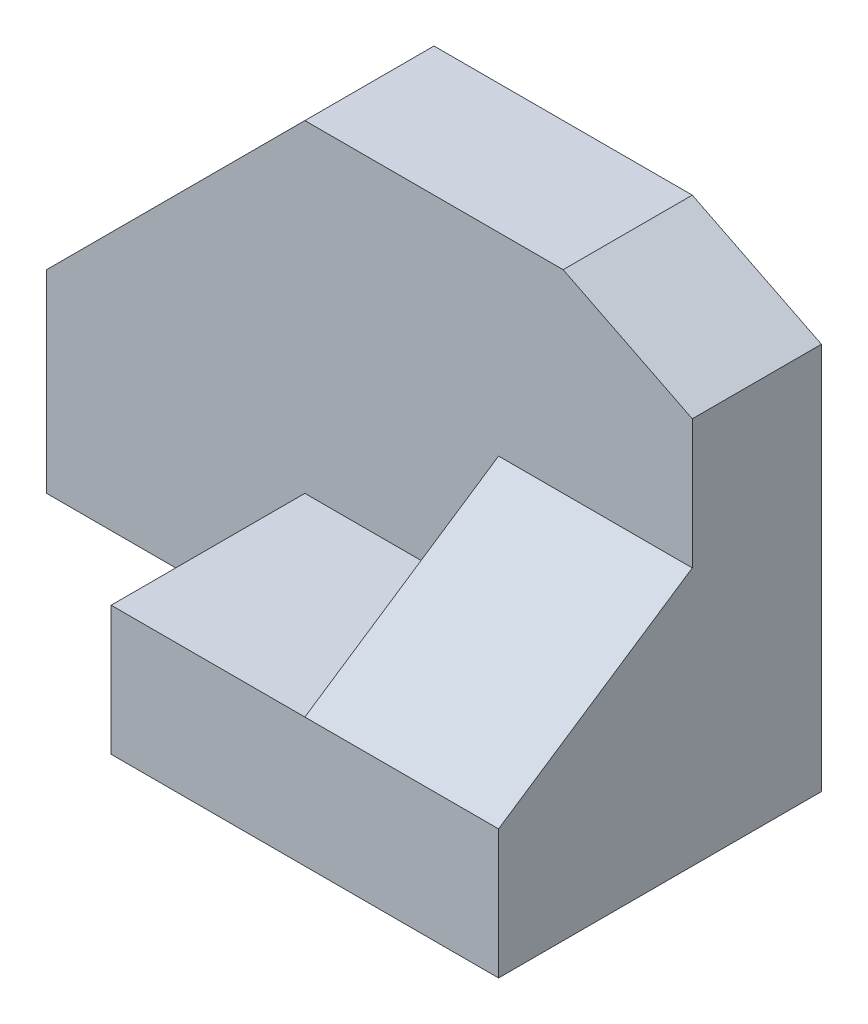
ISO-10303-21;
HEADER;
FILE_DESCRIPTION(('STEP AP214'),'2;1');
FILE_NAME('part.step','',(''),(''),'','','');
FILE_SCHEMA(('AUTOMOTIVE_DESIGN { 1 0 10303 214 1 1 1 1 }'));
ENDSEC;
DATA;
#1=APPLICATION_CONTEXT('core data for automotive mechanical design processes');
#2=APPLICATION_PROTOCOL_DEFINITION('international standard','automotive_design',2000,#1);
#3=PRODUCT_CONTEXT('',#1,'mechanical');
#4=PRODUCT('Part','Part','',(#3));
#5=PRODUCT_RELATED_PRODUCT_CATEGORY('part','',(#4));
#6=PRODUCT_DEFINITION_FORMATION('','',#4);
#7=PRODUCT_DEFINITION_CONTEXT('part definition',#1,'design');
#8=PRODUCT_DEFINITION('design','',#6,#7);
#9=PRODUCT_DEFINITION_SHAPE('','',#8);
#10=(LENGTH_UNIT() NAMED_UNIT(*) SI_UNIT(.MILLI.,.METRE.));
#11=(NAMED_UNIT(*) PLANE_ANGLE_UNIT() SI_UNIT($,.RADIAN.));
#12=(NAMED_UNIT(*) SI_UNIT($,.STERADIAN.) SOLID_ANGLE_UNIT());
#13=UNCERTAINTY_MEASURE_WITH_UNIT(LENGTH_MEASURE(1.E-05),#10,'distance_accuracy_value','');
#14=(GEOMETRIC_REPRESENTATION_CONTEXT(3) GLOBAL_UNCERTAINTY_ASSIGNED_CONTEXT((#13)) GLOBAL_UNIT_ASSIGNED_CONTEXT((#10,
#11,#12)) REPRESENTATION_CONTEXT('',''));
#15=CARTESIAN_POINT('',(0.,0.,0.));
#16=DIRECTION('',(0.,0.,1.));
#17=DIRECTION('',(1.,0.,0.));
#18=AXIS2_PLACEMENT_3D('',#15,#16,#17);
#19=CARTESIAN_POINT('',(0.,0.,25.));
#20=DIRECTION('',(0.,0.,1.));
#21=DIRECTION('',(1.,0.,0.));
#22=AXIS2_PLACEMENT_3D('',#19,#20,#21);
#23=PLANE('',#22);
#24=DIRECTION('',(-1.,0.,0.));
#25=VECTOR('',#24,1.);
#26=CARTESIAN_POINT('',(50.,-15.,25.));
#27=LINE('',#26,#25);
#28=CARTESIAN_POINT('',(50.,-15.,25.));
#29=VERTEX_POINT('',#28);
#30=CARTESIAN_POINT('',(20.,-15.,25.));
#31=VERTEX_POINT('',#30);
#32=EDGE_CURVE('E123',#29,#31,#27,.T.);
#33=ORIENTED_EDGE('',*,*,#32,.T.);
#34=DIRECTION('',(-1.,0.,0.));
#35=VECTOR('',#34,1.);
#36=CARTESIAN_POINT('',(20.,-15.,25.));
#37=LINE('',#36,#35);
#38=CARTESIAN_POINT('',(-10.,-15.,25.));
#39=VERTEX_POINT('',#38);
#40=EDGE_CURVE('E151',#31,#39,#37,.T.);
#41=ORIENTED_EDGE('',*,*,#40,.T.);
#42=DIRECTION('',(0.,1.,0.));
#43=VECTOR('',#42,1.);
#44=CARTESIAN_POINT('',(-10.,-35.,25.));
#45=LINE('',#44,#43);
#46=CARTESIAN_POINT('',(-10.,-35.,25.));
#47=VERTEX_POINT('',#46);
#48=EDGE_CURVE('E155',#47,#39,#45,.T.);
#49=ORIENTED_EDGE('',*,*,#48,.F.);
#50=DIRECTION('',(1.,0.,0.));
#51=VECTOR('',#50,1.);
#52=CARTESIAN_POINT('',(-50.,-35.,25.));
#53=LINE('',#52,#51);
#54=CARTESIAN_POINT('',(50.,-35.,25.));
#55=VERTEX_POINT('',#54);
#56=EDGE_CURVE('E182',#47,#55,#53,.T.);
#57=ORIENTED_EDGE('',*,*,#56,.T.);
#58=DIRECTION('',(0.,1.,0.));
#59=VECTOR('',#58,1.);
#60=CARTESIAN_POINT('',(50.,35.,25.));
#61=LINE('',#60,#59);
#62=EDGE_CURVE('E184',#55,#29,#61,.T.);
#63=ORIENTED_EDGE('',*,*,#62,.T.);
#64=EDGE_LOOP('',(#33,#41,#49,#57,#63));
#65=FACE_BOUND('',#64,.T.);
#66=ADVANCED_FACE('F33',(#65),#23,.T.);
#67=CARTESIAN_POINT('',(-50.,35.,25.));
#68=DIRECTION('',(1.,0.,0.));
#69=DIRECTION('',(0.,0.,-1.));
#70=AXIS2_PLACEMENT_3D('',#67,#68,#69);
#71=PLANE('',#70);
#72=DIRECTION('',(0.,0.,-1.));
#73=VECTOR('',#72,1.);
#74=CARTESIAN_POINT('',(-50.,-35.,25.));
#75=LINE('',#74,#73);
#76=CARTESIAN_POINT('',(-50.,-35.,-5.));
#77=VERTEX_POINT('',#76);
#78=CARTESIAN_POINT('',(-50.,-35.,-25.));
#79=VERTEX_POINT('',#78);
#80=EDGE_CURVE('E41',#77,#79,#75,.T.);
#81=ORIENTED_EDGE('',*,*,#80,.F.);
#82=DIRECTION('',(0.,-1.,0.));
#83=VECTOR('',#82,1.);
#84=CARTESIAN_POINT('',(-50.,-35.,-5.));
#85=LINE('',#84,#83);
#86=CARTESIAN_POINT('',(-50.,-5.,-5.));
#87=VERTEX_POINT('',#86);
#88=EDGE_CURVE('E150',#87,#77,#85,.T.);
#89=ORIENTED_EDGE('',*,*,#88,.F.);
#90=DIRECTION('',(0.,0.,1.));
#91=VECTOR('',#90,1.);
#92=CARTESIAN_POINT('',(-50.,-5.,-25.));
#93=LINE('',#92,#91);
#94=CARTESIAN_POINT('',(-50.,-5.,-25.));
#95=VERTEX_POINT('',#94);
#96=EDGE_CURVE('E175',#95,#87,#93,.T.);
#97=ORIENTED_EDGE('',*,*,#96,.F.);
#98=DIRECTION('',(0.,-1.,0.));
#99=VECTOR('',#98,1.);
#100=CARTESIAN_POINT('',(-50.,35.,-25.));
#101=LINE('',#100,#99);
#102=EDGE_CURVE('E179',#95,#79,#101,.T.);
#103=ORIENTED_EDGE('',*,*,#102,.T.);
#104=EDGE_LOOP('',(#81,#89,#97,#103));
#105=FACE_BOUND('',#104,.T.);
#106=ADVANCED_FACE('F35',(#105),#71,.F.);
#107=CARTESIAN_POINT('',(-50.,-35.,25.));
#108=DIRECTION('',(0.,1.,0.));
#109=DIRECTION('',(0.,0.,1.));
#110=AXIS2_PLACEMENT_3D('',#107,#108,#109);
#111=PLANE('',#110);
#112=DIRECTION('',(0.,0.,1.));
#113=VECTOR('',#112,1.);
#114=CARTESIAN_POINT('',(-10.,-35.,25.));
#115=LINE('',#114,#113);
#116=CARTESIAN_POINT('',(-10.,-35.,-5.));
#117=VERTEX_POINT('',#116);
#118=EDGE_CURVE('E160',#117,#47,#115,.T.);
#119=ORIENTED_EDGE('',*,*,#118,.F.);
#120=DIRECTION('',(-1.,0.,0.));
#121=VECTOR('',#120,1.);
#122=CARTESIAN_POINT('',(-10.,-35.,-5.));
#123=LINE('',#122,#121);
#124=EDGE_CURVE('E162',#117,#77,#123,.T.);
#125=ORIENTED_EDGE('',*,*,#124,.T.);
#126=ORIENTED_EDGE('',*,*,#80,.T.);
#127=DIRECTION('',(1.,0.,0.));
#128=VECTOR('',#127,1.);
#129=CARTESIAN_POINT('',(-50.,-35.,-25.));
#130=LINE('',#129,#128);
#131=CARTESIAN_POINT('',(50.,-35.,-25.));
#132=VERTEX_POINT('',#131);
#133=EDGE_CURVE('E190',#79,#132,#130,.T.);
#134=ORIENTED_EDGE('',*,*,#133,.T.);
#135=DIRECTION('',(0.,0.,-1.));
#136=VECTOR('',#135,1.);
#137=CARTESIAN_POINT('',(50.,-35.,25.));
#138=LINE('',#137,#136);
#139=EDGE_CURVE('E187',#55,#132,#138,.T.);
#140=ORIENTED_EDGE('',*,*,#139,.F.);
#141=ORIENTED_EDGE('',*,*,#56,.F.);
#142=EDGE_LOOP('',(#119,#125,#126,#134,#140,#141));
#143=FACE_BOUND('',#142,.T.);
#144=ADVANCED_FACE('F199',(#143),#111,.F.);
#145=CARTESIAN_POINT('',(50.,35.,25.));
#146=DIRECTION('',(-1.,0.,0.));
#147=DIRECTION('',(0.,0.,1.));
#148=AXIS2_PLACEMENT_3D('',#145,#146,#147);
#149=PLANE('',#148);
#150=DIRECTION('',(0.,-1.,0.));
#151=VECTOR('',#150,1.);
#152=CARTESIAN_POINT('',(50.,4.99999999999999,-5.));
#153=LINE('',#152,#151);
#154=CARTESIAN_POINT('',(50.,25.,-5.));
#155=VERTEX_POINT('',#154);
#156=CARTESIAN_POINT('',(50.,4.99999999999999,-5.));
#157=VERTEX_POINT('',#156);
#158=EDGE_CURVE('E119',#155,#157,#153,.T.);
#159=ORIENTED_EDGE('',*,*,#158,.T.);
#160=DIRECTION('',(0.,-0.554700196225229,0.832050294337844));
#161=VECTOR('',#160,1.);
#162=CARTESIAN_POINT('',(50.,-15.,25.));
#163=LINE('',#162,#161);
#164=EDGE_CURVE('E124',#157,#29,#163,.T.);
#165=ORIENTED_EDGE('',*,*,#164,.T.);
#166=ORIENTED_EDGE('',*,*,#62,.F.);
#167=ORIENTED_EDGE('',*,*,#139,.T.);
#168=DIRECTION('',(0.,1.,0.));
#169=VECTOR('',#168,1.);
#170=CARTESIAN_POINT('',(50.,35.,-25.));
#171=LINE('',#170,#169);
#172=CARTESIAN_POINT('',(50.,25.,-25.));
#173=VERTEX_POINT('',#172);
#174=EDGE_CURVE('E192',#132,#173,#171,.T.);
#175=ORIENTED_EDGE('',*,*,#174,.T.);
#176=DIRECTION('',(0.,0.,1.));
#177=VECTOR('',#176,1.);
#178=CARTESIAN_POINT('',(50.,25.,-25.));
#179=LINE('',#178,#177);
#180=EDGE_CURVE('E56',#173,#155,#179,.T.);
#181=ORIENTED_EDGE('',*,*,#180,.T.);
#182=EDGE_LOOP('',(#159,#165,#166,#167,#175,#181));
#183=FACE_BOUND('',#182,.T.);
#184=ADVANCED_FACE('F133',(#183),#149,.F.);
#185=CARTESIAN_POINT('',(-50.,35.,25.));
#186=DIRECTION('',(0.,-1.,0.));
#187=DIRECTION('',(0.,0.,-1.));
#188=AXIS2_PLACEMENT_3D('',#185,#186,#187);
#189=PLANE('',#188);
#190=DIRECTION('',(-1.,0.,0.));
#191=VECTOR('',#190,1.);
#192=CARTESIAN_POINT('',(20.,35.,-5.));
#193=LINE('',#192,#191);
#194=CARTESIAN_POINT('',(30.,35.,-5.));
#195=VERTEX_POINT('',#194);
#196=CARTESIAN_POINT('',(-10.,35.,-5.));
#197=VERTEX_POINT('',#196);
#198=EDGE_CURVE('E148',#195,#197,#193,.T.);
#199=ORIENTED_EDGE('',*,*,#198,.F.);
#200=DIRECTION('',(0.,0.,1.));
#201=VECTOR('',#200,1.);
#202=CARTESIAN_POINT('',(30.,35.,-25.));
#203=LINE('',#202,#201);
#204=CARTESIAN_POINT('',(30.,35.,-25.));
#205=VERTEX_POINT('',#204);
#206=EDGE_CURVE('E168',#205,#195,#203,.T.);
#207=ORIENTED_EDGE('',*,*,#206,.F.);
#208=DIRECTION('',(-1.,0.,0.));
#209=VECTOR('',#208,1.);
#210=CARTESIAN_POINT('',(-50.,35.,-25.));
#211=LINE('',#210,#209);
#212=CARTESIAN_POINT('',(-10.,35.,-25.));
#213=VERTEX_POINT('',#212);
#214=EDGE_CURVE('E185',#205,#213,#211,.T.);
#215=ORIENTED_EDGE('',*,*,#214,.T.);
#216=DIRECTION('',(0.,0.,1.));
#217=VECTOR('',#216,1.);
#218=CARTESIAN_POINT('',(-10.,35.,-25.));
#219=LINE('',#218,#217);
#220=EDGE_CURVE('E176',#213,#197,#219,.T.);
#221=ORIENTED_EDGE('',*,*,#220,.T.);
#222=EDGE_LOOP('',(#199,#207,#215,#221));
#223=FACE_BOUND('',#222,.T.);
#224=ADVANCED_FACE('F223',(#223),#189,.F.);
#225=CARTESIAN_POINT('',(0.,0.,-25.));
#226=DIRECTION('',(0.,0.,1.));
#227=DIRECTION('',(1.,0.,0.));
#228=AXIS2_PLACEMENT_3D('',#225,#226,#227);
#229=PLANE('',#228);
#230=ORIENTED_EDGE('',*,*,#214,.F.);
#231=DIRECTION('',(0.894427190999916,-0.447213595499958,0.));
#232=VECTOR('',#231,1.);
#233=CARTESIAN_POINT('',(30.,35.,-25.));
#234=LINE('',#233,#232);
#235=EDGE_CURVE('E166',#205,#173,#234,.T.);
#236=ORIENTED_EDGE('',*,*,#235,.T.);
#237=ORIENTED_EDGE('',*,*,#174,.F.);
#238=ORIENTED_EDGE('',*,*,#133,.F.);
#239=ORIENTED_EDGE('',*,*,#102,.F.);
#240=DIRECTION('',(0.707106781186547,0.707106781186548,0.));
#241=VECTOR('',#240,1.);
#242=CARTESIAN_POINT('',(-50.,-5.,-25.));
#243=LINE('',#242,#241);
#244=EDGE_CURVE('E170',#95,#213,#243,.T.);
#245=ORIENTED_EDGE('',*,*,#244,.T.);
#246=EDGE_LOOP('',(#230,#236,#237,#238,#239,#245));
#247=FACE_BOUND('',#246,.T.);
#248=ADVANCED_FACE('F210',(#247),#229,.F.);
#249=CARTESIAN_POINT('',(-50.,-5.,-25.));
#250=DIRECTION('',(0.707106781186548,-0.707106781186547,0.));
#251=DIRECTION('',(0.707106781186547,0.707106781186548,0.));
#252=AXIS2_PLACEMENT_3D('',#249,#250,#251);
#253=PLANE('',#252);
#254=ORIENTED_EDGE('',*,*,#96,.T.);
#255=DIRECTION('',(0.707106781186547,0.707106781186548,0.));
#256=VECTOR('',#255,1.);
#257=CARTESIAN_POINT('',(-50.,-5.,-5.));
#258=LINE('',#257,#256);
#259=EDGE_CURVE('E11',#87,#197,#258,.T.);
#260=ORIENTED_EDGE('',*,*,#259,.T.);
#261=ORIENTED_EDGE('',*,*,#220,.F.);
#262=ORIENTED_EDGE('',*,*,#244,.F.);
#263=EDGE_LOOP('',(#254,#260,#261,#262));
#264=FACE_BOUND('',#263,.T.);
#265=ADVANCED_FACE('F219',(#264),#253,.F.);
#266=CARTESIAN_POINT('',(30.,35.,-25.));
#267=DIRECTION('',(-0.447213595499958,-0.894427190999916,0.));
#268=DIRECTION('',(0.894427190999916,-0.447213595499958,0.));
#269=AXIS2_PLACEMENT_3D('',#266,#267,#268);
#270=PLANE('',#269);
#271=ORIENTED_EDGE('',*,*,#206,.T.);
#272=DIRECTION('',(0.894427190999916,-0.447213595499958,0.));
#273=VECTOR('',#272,1.);
#274=CARTESIAN_POINT('',(30.,35.,-5.));
#275=LINE('',#274,#273);
#276=EDGE_CURVE('E139',#195,#155,#275,.T.);
#277=ORIENTED_EDGE('',*,*,#276,.T.);
#278=ORIENTED_EDGE('',*,*,#180,.F.);
#279=ORIENTED_EDGE('',*,*,#235,.F.);
#280=EDGE_LOOP('',(#271,#277,#278,#279));
#281=FACE_BOUND('',#280,.T.);
#282=ADVANCED_FACE('F224',(#281),#270,.F.);
#283=CARTESIAN_POINT('',(-10.,-35.,-5.));
#284=DIRECTION('',(0.,0.,-1.));
#285=DIRECTION('',(-1.,0.,0.));
#286=AXIS2_PLACEMENT_3D('',#283,#284,#285);
#287=PLANE('',#286);
#288=ORIENTED_EDGE('',*,*,#88,.T.);
#289=ORIENTED_EDGE('',*,*,#124,.F.);
#290=DIRECTION('',(0.,-1.,0.));
#291=VECTOR('',#290,1.);
#292=CARTESIAN_POINT('',(-10.,-35.,-5.));
#293=LINE('',#292,#291);
#294=CARTESIAN_POINT('',(-10.,-15.,-5.));
#295=VERTEX_POINT('',#294);
#296=EDGE_CURVE('E158',#295,#117,#293,.T.);
#297=ORIENTED_EDGE('',*,*,#296,.F.);
#298=DIRECTION('',(-1.,0.,0.));
#299=VECTOR('',#298,1.);
#300=CARTESIAN_POINT('',(20.,-15.,-4.99999999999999));
#301=LINE('',#300,#299);
#302=CARTESIAN_POINT('',(20.,-15.,-4.99999999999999));
#303=VERTEX_POINT('',#302);
#304=EDGE_CURVE('E48',#303,#295,#301,.T.);
#305=ORIENTED_EDGE('',*,*,#304,.F.);
#306=DIRECTION('',(0.,-1.,0.));
#307=VECTOR('',#306,1.);
#308=CARTESIAN_POINT('',(20.,35.,-5.));
#309=LINE('',#308,#307);
#310=CARTESIAN_POINT('',(20.,4.99999999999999,-5.));
#311=VERTEX_POINT('',#310);
#312=EDGE_CURVE('E120',#311,#303,#309,.T.);
#313=ORIENTED_EDGE('',*,*,#312,.F.);
#314=DIRECTION('',(-1.,0.,0.));
#315=VECTOR('',#314,1.);
#316=CARTESIAN_POINT('',(50.,4.99999999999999,-5.));
#317=LINE('',#316,#315);
#318=EDGE_CURVE('E114',#157,#311,#317,.T.);
#319=ORIENTED_EDGE('',*,*,#318,.F.);
#320=ORIENTED_EDGE('',*,*,#158,.F.);
#321=ORIENTED_EDGE('',*,*,#276,.F.);
#322=ORIENTED_EDGE('',*,*,#198,.T.);
#323=ORIENTED_EDGE('',*,*,#259,.F.);
#324=EDGE_LOOP('',(#288,#289,#297,#305,#313,#319,#320,#321,#322,#323));
#325=FACE_BOUND('',#324,.T.);
#326=ADVANCED_FACE('F116',(#325),#287,.F.);
#327=CARTESIAN_POINT('',(-10.,0.,0.));
#328=DIRECTION('',(-1.,0.,0.));
#329=DIRECTION('',(0.,0.,1.));
#330=AXIS2_PLACEMENT_3D('',#327,#328,#329);
#331=PLANE('',#330);
#332=DIRECTION('',(0.,0.,1.));
#333=VECTOR('',#332,1.);
#334=CARTESIAN_POINT('',(-10.,-15.,-4.99999999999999));
#335=LINE('',#334,#333);
#336=EDGE_CURVE('E142',#295,#39,#335,.T.);
#337=ORIENTED_EDGE('',*,*,#336,.F.);
#338=ORIENTED_EDGE('',*,*,#296,.T.);
#339=ORIENTED_EDGE('',*,*,#118,.T.);
#340=ORIENTED_EDGE('',*,*,#48,.T.);
#341=EDGE_LOOP('',(#337,#338,#339,#340));
#342=FACE_BOUND('',#341,.T.);
#343=ADVANCED_FACE('F216',(#342),#331,.T.);
#344=CARTESIAN_POINT('',(20.,-15.,-4.99999999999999));
#345=DIRECTION('',(0.,-1.,0.));
#346=DIRECTION('',(0.,0.,-1.));
#347=AXIS2_PLACEMENT_3D('',#344,#345,#346);
#348=PLANE('',#347);
#349=ORIENTED_EDGE('',*,*,#336,.T.);
#350=ORIENTED_EDGE('',*,*,#40,.F.);
#351=DIRECTION('',(0.,0.,1.));
#352=VECTOR('',#351,1.);
#353=CARTESIAN_POINT('',(20.,-15.,-4.99999999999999));
#354=LINE('',#353,#352);
#355=EDGE_CURVE('E144',#303,#31,#354,.T.);
#356=ORIENTED_EDGE('',*,*,#355,.F.);
#357=ORIENTED_EDGE('',*,*,#304,.T.);
#358=EDGE_LOOP('',(#349,#350,#356,#357));
#359=FACE_BOUND('',#358,.T.);
#360=ADVANCED_FACE('F274',(#359),#348,.F.);
#361=CARTESIAN_POINT('',(20.,0.,0.));
#362=DIRECTION('',(-1.,0.,0.));
#363=DIRECTION('',(0.,0.,1.));
#364=AXIS2_PLACEMENT_3D('',#361,#362,#363);
#365=PLANE('',#364);
#366=DIRECTION('',(0.,-0.554700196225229,0.832050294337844));
#367=VECTOR('',#366,1.);
#368=CARTESIAN_POINT('',(20.,-15.,25.));
#369=LINE('',#368,#367);
#370=EDGE_CURVE('E135',#311,#31,#369,.T.);
#371=ORIENTED_EDGE('',*,*,#370,.F.);
#372=ORIENTED_EDGE('',*,*,#312,.T.);
#373=ORIENTED_EDGE('',*,*,#355,.T.);
#374=EDGE_LOOP('',(#371,#372,#373));
#375=FACE_BOUND('',#374,.T.);
#376=ADVANCED_FACE('F302',(#375),#365,.T.);
#377=CARTESIAN_POINT('',(50.,-15.,25.));
#378=DIRECTION('',(0.,-0.832050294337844,-0.554700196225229));
#379=DIRECTION('',(0.,0.554700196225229,-0.832050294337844));
#380=AXIS2_PLACEMENT_3D('',#377,#378,#379);
#381=PLANE('',#380);
#382=ORIENTED_EDGE('',*,*,#370,.T.);
#383=ORIENTED_EDGE('',*,*,#32,.F.);
#384=ORIENTED_EDGE('',*,*,#164,.F.);
#385=ORIENTED_EDGE('',*,*,#318,.T.);
#386=EDGE_LOOP('',(#382,#383,#384,#385));
#387=FACE_BOUND('',#386,.T.);
#388=ADVANCED_FACE('F127',(#387),#381,.F.);
#389=CLOSED_SHELL('',(#66,#106,#144,#184,#224,#248,#265,#282,#326,#343,#360,#376,#388));
#390=MANIFOLD_SOLID_BREP('B2',#389);
#391=ADVANCED_BREP_SHAPE_REPRESENTATION('',(#18,#390),#14);
#392=SHAPE_DEFINITION_REPRESENTATION(#9,#391);
ENDSEC;
END-ISO-10303-21;
